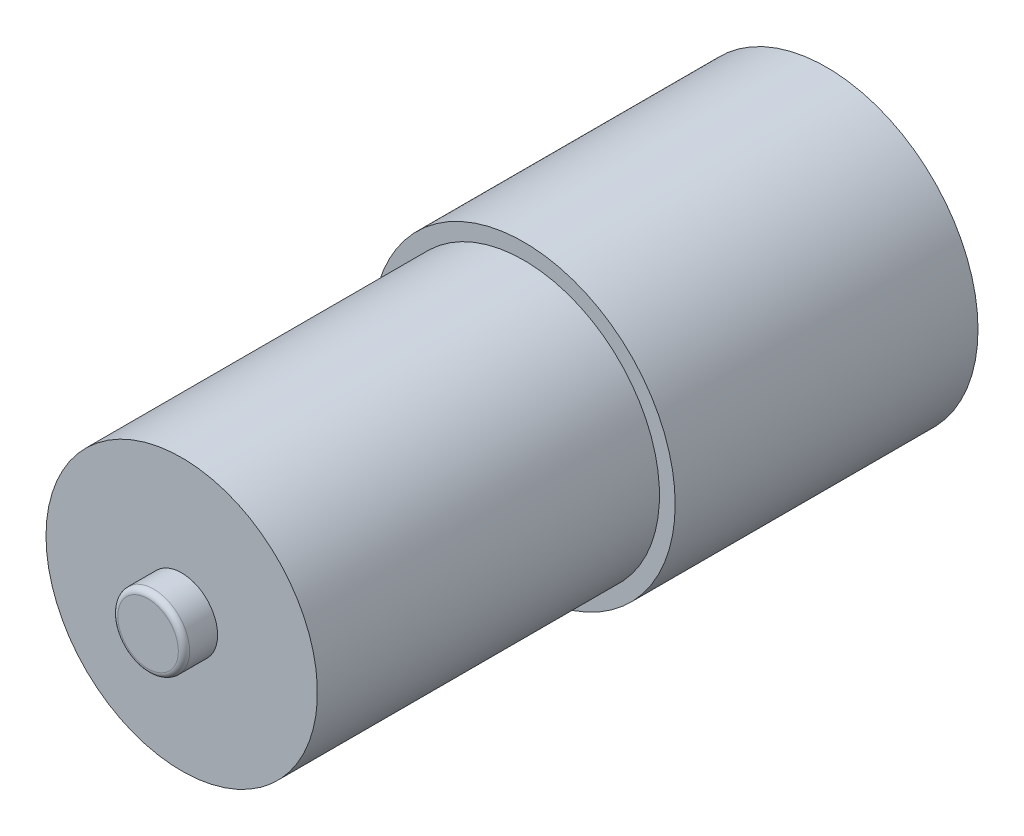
ISO-10303-21;
HEADER;
FILE_DESCRIPTION(('STEP AP214'),'2;1');
FILE_NAME('part.step','',(''),(''),'','','');
FILE_SCHEMA(('AUTOMOTIVE_DESIGN { 1 0 10303 214 1 1 1 1 }'));
ENDSEC;
DATA;
#1=APPLICATION_CONTEXT('core data for automotive mechanical design processes');
#2=APPLICATION_PROTOCOL_DEFINITION('international standard','automotive_design',2000,#1);
#3=PRODUCT_CONTEXT('',#1,'mechanical');
#4=PRODUCT('Part','Part','',(#3));
#5=PRODUCT_RELATED_PRODUCT_CATEGORY('part','',(#4));
#6=PRODUCT_DEFINITION_FORMATION('','',#4);
#7=PRODUCT_DEFINITION_CONTEXT('part definition',#1,'design');
#8=PRODUCT_DEFINITION('design','',#6,#7);
#9=PRODUCT_DEFINITION_SHAPE('','',#8);
#10=(LENGTH_UNIT() NAMED_UNIT(*) SI_UNIT(.MILLI.,.METRE.));
#11=(NAMED_UNIT(*) PLANE_ANGLE_UNIT() SI_UNIT($,.RADIAN.));
#12=(NAMED_UNIT(*) SI_UNIT($,.STERADIAN.) SOLID_ANGLE_UNIT());
#13=UNCERTAINTY_MEASURE_WITH_UNIT(LENGTH_MEASURE(1.E-05),#10,'distance_accuracy_value','');
#14=(GEOMETRIC_REPRESENTATION_CONTEXT(3) GLOBAL_UNCERTAINTY_ASSIGNED_CONTEXT((#13)) GLOBAL_UNIT_ASSIGNED_CONTEXT((#10,
#11,#12)) REPRESENTATION_CONTEXT('',''));
#15=CARTESIAN_POINT('',(0.,0.,0.));
#16=DIRECTION('',(0.,0.,1.));
#17=DIRECTION('',(1.,0.,0.));
#18=AXIS2_PLACEMENT_3D('',#15,#16,#17);
#19=CARTESIAN_POINT('',(0.,0.,30.5));
#20=DIRECTION('',(0.,0.,-1.));
#21=DIRECTION('',(-1.,0.,0.));
#22=AXIS2_PLACEMENT_3D('',#19,#20,#21);
#23=CYLINDRICAL_SURFACE('',#22,12.1);
#24=CARTESIAN_POINT('',(0.,0.,30.5));
#25=DIRECTION('',(0.,0.,1.));
#26=DIRECTION('',(1.,0.,0.));
#27=AXIS2_PLACEMENT_3D('',#24,#25,#26);
#28=CIRCLE('',#27,12.1);
#29=CARTESIAN_POINT('',(-12.1,0.,30.5));
#30=VERTEX_POINT('',#29);
#31=EDGE_CURVE('E62',#30,#30,#28,.T.);
#32=CARTESIAN_POINT('',(0.,0.,0.));
#33=DIRECTION('',(0.,0.,1.));
#34=DIRECTION('',(1.,0.,0.));
#35=AXIS2_PLACEMENT_3D('',#32,#33,#34);
#36=CIRCLE('',#35,12.1);
#37=CARTESIAN_POINT('',(-12.1,0.,0.));
#38=VERTEX_POINT('',#37);
#39=EDGE_CURVE('E63',#38,#38,#36,.T.);
#40=CARTESIAN_POINT('',(-12.1,0.,30.5));
#41=CARTESIAN_POINT('',(-12.1,0.,30.1822916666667));
#42=CARTESIAN_POINT('',(-12.1,0.,29.8645833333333));
#43=CARTESIAN_POINT('',(-12.1,0.,29.2291666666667));
#44=CARTESIAN_POINT('',(-12.1,0.,28.9114583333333));
#45=CARTESIAN_POINT('',(-12.1,0.,28.2760416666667));
#46=CARTESIAN_POINT('',(-12.1,0.,27.9583333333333));
#47=CARTESIAN_POINT('',(-12.1,0.,27.3229166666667));
#48=CARTESIAN_POINT('',(-12.1,0.,27.0052083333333));
#49=CARTESIAN_POINT('',(-12.1,0.,26.3697916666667));
#50=CARTESIAN_POINT('',(-12.1,0.,26.0520833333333));
#51=CARTESIAN_POINT('',(-12.1,0.,25.4166666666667));
#52=CARTESIAN_POINT('',(-12.1,0.,25.0989583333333));
#53=CARTESIAN_POINT('',(-12.1,0.,24.4635416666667));
#54=CARTESIAN_POINT('',(-12.1,0.,24.1458333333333));
#55=CARTESIAN_POINT('',(-12.1,0.,23.5104166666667));
#56=CARTESIAN_POINT('',(-12.1,0.,23.1927083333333));
#57=CARTESIAN_POINT('',(-12.1,0.,22.5572916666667));
#58=CARTESIAN_POINT('',(-12.1,0.,22.2395833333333));
#59=CARTESIAN_POINT('',(-12.1,0.,21.6041666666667));
#60=CARTESIAN_POINT('',(-12.1,0.,21.2864583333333));
#61=CARTESIAN_POINT('',(-12.1,0.,20.6510416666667));
#62=CARTESIAN_POINT('',(-12.1,0.,20.3333333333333));
#63=CARTESIAN_POINT('',(-12.1,0.,19.6979166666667));
#64=CARTESIAN_POINT('',(-12.1,0.,19.3802083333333));
#65=CARTESIAN_POINT('',(-12.1,0.,18.7447916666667));
#66=CARTESIAN_POINT('',(-12.1,0.,18.4270833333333));
#67=CARTESIAN_POINT('',(-12.1,0.,17.7916666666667));
#68=CARTESIAN_POINT('',(-12.1,0.,17.4739583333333));
#69=CARTESIAN_POINT('',(-12.1,0.,16.8385416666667));
#70=CARTESIAN_POINT('',(-12.1,0.,16.5208333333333));
#71=CARTESIAN_POINT('',(-12.1,0.,15.8854166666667));
#72=CARTESIAN_POINT('',(-12.1,0.,15.5677083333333));
#73=CARTESIAN_POINT('',(-12.1,0.,14.9322916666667));
#74=CARTESIAN_POINT('',(-12.1,0.,14.6145833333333));
#75=CARTESIAN_POINT('',(-12.1,0.,13.9791666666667));
#76=CARTESIAN_POINT('',(-12.1,0.,13.6614583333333));
#77=CARTESIAN_POINT('',(-12.1,0.,13.0260416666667));
#78=CARTESIAN_POINT('',(-12.1,0.,12.7083333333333));
#79=CARTESIAN_POINT('',(-12.1,0.,12.0729166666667));
#80=CARTESIAN_POINT('',(-12.1,0.,11.7552083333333));
#81=CARTESIAN_POINT('',(-12.1,0.,11.1197916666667));
#82=CARTESIAN_POINT('',(-12.1,0.,10.8020833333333));
#83=CARTESIAN_POINT('',(-12.1,0.,10.1666666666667));
#84=CARTESIAN_POINT('',(-12.1,0.,9.84895833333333));
#85=CARTESIAN_POINT('',(-12.1,0.,9.21354166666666));
#86=CARTESIAN_POINT('',(-12.1,0.,8.89583333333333));
#87=CARTESIAN_POINT('',(-12.1,0.,8.26041666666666));
#88=CARTESIAN_POINT('',(-12.1,0.,7.94270833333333));
#89=CARTESIAN_POINT('',(-12.1,0.,7.30729166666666));
#90=CARTESIAN_POINT('',(-12.1,0.,6.98958333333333));
#91=CARTESIAN_POINT('',(-12.1,0.,6.35416666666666));
#92=CARTESIAN_POINT('',(-12.1,0.,6.03645833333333));
#93=CARTESIAN_POINT('',(-12.1,0.,5.40104166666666));
#94=CARTESIAN_POINT('',(-12.1,0.,5.08333333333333));
#95=CARTESIAN_POINT('',(-12.1,0.,4.44791666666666));
#96=CARTESIAN_POINT('',(-12.1,0.,4.13020833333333));
#97=CARTESIAN_POINT('',(-12.1,0.,3.49479166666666));
#98=CARTESIAN_POINT('',(-12.1,0.,3.17708333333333));
#99=CARTESIAN_POINT('',(-12.1,0.,2.54166666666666));
#100=CARTESIAN_POINT('',(-12.1,0.,2.22395833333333));
#101=CARTESIAN_POINT('',(-12.1,0.,1.58854166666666));
#102=CARTESIAN_POINT('',(-12.1,0.,1.27083333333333));
#103=CARTESIAN_POINT('',(-12.1,0.,0.635416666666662));
#104=CARTESIAN_POINT('',(-12.1,0.,0.317708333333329));
#105=CARTESIAN_POINT('',(-12.1,0.,0.));
#106=B_SPLINE_CURVE_WITH_KNOTS('',3,(#40,#41,#42,#43,#44,#45,#46,#47,#48,#49,#50,#51,#52,#53,
#54,#55,#56,#57,#58,#59,#60,#61,#62,#63,#64,#65,#66,#67,#68,#69,#70,#71,#72,#73,#74,#75,#76,#77,
#78,#79,#80,#81,#82,#83,#84,#85,#86,#87,#88,#89,#90,#91,#92,#93,#94,#95,#96,#97,#98,#99,#100,
#101,#102,#103,#104,#105),.UNSPECIFIED.,.F.,.F.,(4,2,2,2,2,2,2,2,2,2,2,2,2,2,2,2,2,2,2,2,2,2,2,
2,2,2,2,2,2,2,2,2,4),(0.,0.953124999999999,1.90625,2.859375,3.8125,4.765625,5.71875,6.671875,
7.625,8.57812499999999,9.53125,10.484375,11.4375,12.390625,13.34375,14.296875,15.25,16.203125,
17.15625,18.109375,19.0625,20.015625,20.96875,21.921875,22.875,23.828125,24.78125,25.734375,
26.6875,27.640625,28.59375,29.546875,30.5),.UNSPECIFIED.);
#107=EDGE_CURVE('BSEAM33',#30,#38,#106,.T.);
#108=ORIENTED_EDGE('',*,*,#31,.F.);
#109=ORIENTED_EDGE('',*,*,#39,.T.);
#110=ORIENTED_EDGE('',*,*,#107,.T.);
#111=ORIENTED_EDGE('',*,*,#107,.F.);
#112=EDGE_LOOP('',(#108,#110,#109,#111));
#113=FACE_BOUND('',#112,.T.);
#114=ADVANCED_FACE('F33',(#113),#23,.T.);
#115=CARTESIAN_POINT('',(0.,0.,30.5));
#116=DIRECTION('',(0.,0.,1.));
#117=DIRECTION('',(1.,0.,0.));
#118=AXIS2_PLACEMENT_3D('',#115,#116,#117);
#119=PLANE('',#118);
#120=CARTESIAN_POINT('',(0.,0.,30.5));
#121=DIRECTION('',(0.,0.,1.));
#122=DIRECTION('',(1.,0.,0.));
#123=AXIS2_PLACEMENT_3D('',#120,#121,#122);
#124=CIRCLE('',#123,3.2);
#125=CARTESIAN_POINT('',(3.2,0.,30.5));
#126=VERTEX_POINT('',#125);
#127=EDGE_CURVE('E44',#126,#126,#124,.T.);
#128=ORIENTED_EDGE('',*,*,#127,.F.);
#129=EDGE_LOOP('',(#128));
#130=FACE_BOUND('',#129,.T.);
#131=ORIENTED_EDGE('',*,*,#31,.T.);
#132=EDGE_LOOP('',(#131));
#133=FACE_BOUND('',#132,.T.);
#134=ADVANCED_FACE('F80',(#130,#133),#119,.T.);
#135=CARTESIAN_POINT('',(0.,0.,-27.));
#136=DIRECTION('',(0.,0.,1.));
#137=DIRECTION('',(1.,0.,0.));
#138=AXIS2_PLACEMENT_3D('',#135,#136,#137);
#139=CYLINDRICAL_SURFACE('',#138,13.5);
#140=CARTESIAN_POINT('',(0.,0.,-27.));
#141=DIRECTION('',(0.,0.,-1.));
#142=DIRECTION('',(-1.,0.,0.));
#143=AXIS2_PLACEMENT_3D('',#140,#141,#142);
#144=CIRCLE('',#143,13.5);
#145=CARTESIAN_POINT('',(-13.5,0.,-27.));
#146=VERTEX_POINT('',#145);
#147=EDGE_CURVE('E66',#146,#146,#144,.T.);
#148=ORIENTED_EDGE('',*,*,#147,.F.);
#149=EDGE_LOOP('',(#148));
#150=FACE_BOUND('',#149,.T.);
#151=CARTESIAN_POINT('',(0.,0.,0.));
#152=DIRECTION('',(0.,0.,-1.));
#153=DIRECTION('',(-1.,0.,0.));
#154=AXIS2_PLACEMENT_3D('',#151,#152,#153);
#155=CIRCLE('',#154,13.5);
#156=CARTESIAN_POINT('',(-13.5,0.,0.));
#157=VERTEX_POINT('',#156);
#158=EDGE_CURVE('E69',#157,#157,#155,.T.);
#159=ORIENTED_EDGE('',*,*,#158,.T.);
#160=EDGE_LOOP('',(#159));
#161=FACE_BOUND('',#160,.T.);
#162=ADVANCED_FACE('F77',(#150,#161),#139,.T.);
#163=CARTESIAN_POINT('',(0.,0.,-27.));
#164=DIRECTION('',(0.,0.,-1.));
#165=DIRECTION('',(-1.,0.,0.));
#166=AXIS2_PLACEMENT_3D('',#163,#164,#165);
#167=PLANE('',#166);
#168=CARTESIAN_POINT('',(0.,0.,-27.));
#169=DIRECTION('',(0.,0.,-1.));
#170=DIRECTION('',(-1.,0.,0.));
#171=AXIS2_PLACEMENT_3D('',#168,#169,#170);
#172=CIRCLE('',#171,2.59999999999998);
#173=CARTESIAN_POINT('',(-2.59999999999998,0.,-27.));
#174=VERTEX_POINT('',#173);
#175=EDGE_CURVE('E53',#174,#174,#172,.F.);
#176=ORIENTED_EDGE('',*,*,#175,.T.);
#177=EDGE_LOOP('',(#176));
#178=FACE_BOUND('',#177,.T.);
#179=ORIENTED_EDGE('',*,*,#147,.T.);
#180=EDGE_LOOP('',(#179));
#181=FACE_BOUND('',#180,.T.);
#182=ADVANCED_FACE('F75',(#178,#181),#167,.T.);
#183=CARTESIAN_POINT('',(0.,0.,0.));
#184=DIRECTION('',(0.,0.,-1.));
#185=DIRECTION('',(-1.,0.,0.));
#186=AXIS2_PLACEMENT_3D('',#183,#184,#185);
#187=PLANE('',#186);
#188=ORIENTED_EDGE('',*,*,#39,.F.);
#189=EDGE_LOOP('',(#188));
#190=FACE_BOUND('',#189,.T.);
#191=ORIENTED_EDGE('',*,*,#158,.F.);
#192=EDGE_LOOP('',(#191));
#193=FACE_BOUND('',#192,.T.);
#194=ADVANCED_FACE('F84',(#190,#193),#187,.F.);
#195=CARTESIAN_POINT('',(0.,0.,-33.3));
#196=DIRECTION('',(0.,0.,1.));
#197=DIRECTION('',(1.,0.,0.));
#198=AXIS2_PLACEMENT_3D('',#195,#196,#197);
#199=CYLINDRICAL_SURFACE('',#198,2.1);
#200=CARTESIAN_POINT('',(0.,0.,-27.5));
#201=DIRECTION('',(0.,0.,-1.));
#202=DIRECTION('',(-1.,0.,0.));
#203=AXIS2_PLACEMENT_3D('',#200,#201,#202);
#204=CIRCLE('',#203,2.1);
#205=CARTESIAN_POINT('',(-2.1,0.,-27.5));
#206=VERTEX_POINT('',#205);
#207=EDGE_CURVE('E56',#206,#206,#204,.T.);
#208=ORIENTED_EDGE('',*,*,#207,.T.);
#209=EDGE_LOOP('',(#208));
#210=FACE_BOUND('',#209,.T.);
#211=CARTESIAN_POINT('',(0.,0.,-32.8));
#212=DIRECTION('',(0.,0.,-1.));
#213=DIRECTION('',(-1.,0.,0.));
#214=AXIS2_PLACEMENT_3D('',#211,#212,#213);
#215=CIRCLE('',#214,2.1);
#216=CARTESIAN_POINT('',(-2.1,0.,-32.8));
#217=VERTEX_POINT('',#216);
#218=EDGE_CURVE('E59',#217,#217,#215,.F.);
#219=ORIENTED_EDGE('',*,*,#218,.T.);
#220=EDGE_LOOP('',(#219));
#221=FACE_BOUND('',#220,.T.);
#222=ADVANCED_FACE('F86',(#210,#221),#199,.T.);
#223=CARTESIAN_POINT('',(0.,0.,-33.3));
#224=DIRECTION('',(0.,0.,-1.));
#225=DIRECTION('',(-1.,0.,0.));
#226=AXIS2_PLACEMENT_3D('',#223,#224,#225);
#227=PLANE('',#226);
#228=CARTESIAN_POINT('',(0.,0.,-33.3));
#229=DIRECTION('',(0.,0.,-1.));
#230=DIRECTION('',(-1.,0.,0.));
#231=AXIS2_PLACEMENT_3D('',#228,#229,#230);
#232=CIRCLE('',#231,1.6);
#233=CARTESIAN_POINT('',(-1.6,0.,-33.3));
#234=VERTEX_POINT('',#233);
#235=EDGE_CURVE('E48',#234,#234,#232,.T.);
#236=ORIENTED_EDGE('',*,*,#235,.T.);
#237=EDGE_LOOP('',(#236));
#238=FACE_BOUND('',#237,.T.);
#239=ADVANCED_FACE('F93',(#238),#227,.T.);
#240=CARTESIAN_POINT('',(0.,0.,-27.5));
#241=DIRECTION('',(0.,0.,1.));
#242=DIRECTION('',(1.,0.,0.));
#243=AXIS2_PLACEMENT_3D('',#240,#241,#242);
#244=CONICAL_SURFACE('',#243,2.1,0.785398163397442);
#245=ORIENTED_EDGE('',*,*,#175,.F.);
#246=EDGE_LOOP('',(#245));
#247=FACE_BOUND('',#246,.T.);
#248=ORIENTED_EDGE('',*,*,#207,.F.);
#249=EDGE_LOOP('',(#248));
#250=FACE_BOUND('',#249,.T.);
#251=ADVANCED_FACE('F111',(#247,#250),#244,.T.);
#252=CARTESIAN_POINT('',(0.,0.,-33.3));
#253=DIRECTION('',(0.,0.,1.));
#254=DIRECTION('',(1.,0.,0.));
#255=AXIS2_PLACEMENT_3D('',#252,#253,#254);
#256=CONICAL_SURFACE('',#255,1.6,0.785398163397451);
#257=ORIENTED_EDGE('',*,*,#218,.F.);
#258=EDGE_LOOP('',(#257));
#259=FACE_BOUND('',#258,.T.);
#260=ORIENTED_EDGE('',*,*,#235,.F.);
#261=EDGE_LOOP('',(#260));
#262=FACE_BOUND('',#261,.T.);
#263=ADVANCED_FACE('F116',(#259,#262),#256,.T.);
#264=CARTESIAN_POINT('',(0.,0.,33.5));
#265=DIRECTION('',(0.,0.,-1.));
#266=DIRECTION('',(-1.,0.,0.));
#267=AXIS2_PLACEMENT_3D('',#264,#265,#266);
#268=CYLINDRICAL_SURFACE('',#267,3.2);
#269=CARTESIAN_POINT('',(0.,0.,33.));
#270=DIRECTION('',(0.,0.,1.));
#271=DIRECTION('',(1.,0.,0.));
#272=AXIS2_PLACEMENT_3D('',#269,#270,#271);
#273=CIRCLE('',#272,3.2);
#274=CARTESIAN_POINT('',(3.2,0.,33.));
#275=VERTEX_POINT('',#274);
#276=EDGE_CURVE('E10',#275,#275,#273,.F.);
#277=ORIENTED_EDGE('',*,*,#276,.T.);
#278=EDGE_LOOP('',(#277));
#279=FACE_BOUND('',#278,.T.);
#280=ORIENTED_EDGE('',*,*,#127,.T.);
#281=EDGE_LOOP('',(#280));
#282=FACE_BOUND('',#281,.T.);
#283=ADVANCED_FACE('F121',(#279,#282),#268,.T.);
#284=CARTESIAN_POINT('',(0.,0.,33.5));
#285=DIRECTION('',(0.,0.,1.));
#286=DIRECTION('',(1.,0.,0.));
#287=AXIS2_PLACEMENT_3D('',#284,#285,#286);
#288=PLANE('',#287);
#289=CARTESIAN_POINT('',(0.,0.,33.5));
#290=DIRECTION('',(0.,0.,1.));
#291=DIRECTION('',(1.,0.,0.));
#292=AXIS2_PLACEMENT_3D('',#289,#290,#291);
#293=CIRCLE('',#292,2.7);
#294=CARTESIAN_POINT('',(2.7,0.,33.5));
#295=VERTEX_POINT('',#294);
#296=EDGE_CURVE('E40',#295,#295,#293,.T.);
#297=ORIENTED_EDGE('',*,*,#296,.T.);
#298=EDGE_LOOP('',(#297));
#299=FACE_BOUND('',#298,.T.);
#300=ADVANCED_FACE('F126',(#299),#288,.T.);
#301=CARTESIAN_POINT('',(0.,0.,33.));
#302=DIRECTION('',(0.,0.,1.));
#303=DIRECTION('',(1.,0.,0.));
#304=AXIS2_PLACEMENT_3D('',#301,#302,#303);
#305=TOROIDAL_SURFACE('',#304,2.7,0.5);
#306=ORIENTED_EDGE('',*,*,#276,.F.);
#307=EDGE_LOOP('',(#306));
#308=FACE_BOUND('',#307,.T.);
#309=ORIENTED_EDGE('',*,*,#296,.F.);
#310=EDGE_LOOP('',(#309));
#311=FACE_BOUND('',#310,.T.);
#312=ADVANCED_FACE('F35',(#308,#311),#305,.T.);
#313=CLOSED_SHELL('',(#114,#134,#162,#182,#194,#222,#239,#251,#263,#283,#300,#312));
#314=MANIFOLD_SOLID_BREP('B2',#313);
#315=ADVANCED_BREP_SHAPE_REPRESENTATION('',(#18,#314),#14);
#316=SHAPE_DEFINITION_REPRESENTATION(#9,#315);
ENDSEC;
END-ISO-10303-21;
